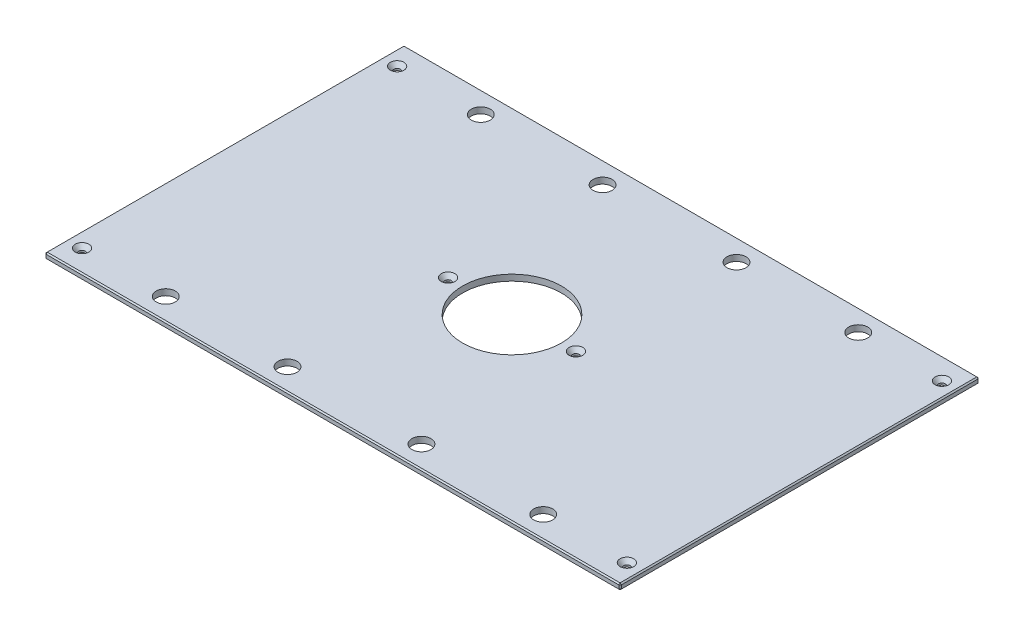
ISO-10303-21;
HEADER;
FILE_DESCRIPTION(('STEP AP214'),'2;1');
FILE_NAME('part.step','',(''),(''),'','','');
FILE_SCHEMA(('AUTOMOTIVE_DESIGN { 1 0 10303 214 1 1 1 1 }'));
ENDSEC;
DATA;
#1=APPLICATION_CONTEXT('core data for automotive mechanical design processes');
#2=APPLICATION_PROTOCOL_DEFINITION('international standard','automotive_design',2000,#1);
#3=PRODUCT_CONTEXT('',#1,'mechanical');
#4=PRODUCT('Part','Part','',(#3));
#5=PRODUCT_RELATED_PRODUCT_CATEGORY('part','',(#4));
#6=PRODUCT_DEFINITION_FORMATION('','',#4);
#7=PRODUCT_DEFINITION_CONTEXT('part definition',#1,'design');
#8=PRODUCT_DEFINITION('design','',#6,#7);
#9=PRODUCT_DEFINITION_SHAPE('','',#8);
#10=(LENGTH_UNIT() NAMED_UNIT(*) SI_UNIT(.MILLI.,.METRE.));
#11=(NAMED_UNIT(*) PLANE_ANGLE_UNIT() SI_UNIT($,.RADIAN.));
#12=(NAMED_UNIT(*) SI_UNIT($,.STERADIAN.) SOLID_ANGLE_UNIT());
#13=UNCERTAINTY_MEASURE_WITH_UNIT(LENGTH_MEASURE(1.E-05),#10,'distance_accuracy_value','');
#14=(GEOMETRIC_REPRESENTATION_CONTEXT(3) GLOBAL_UNCERTAINTY_ASSIGNED_CONTEXT((#13)) GLOBAL_UNIT_ASSIGNED_CONTEXT((#10,
#11,#12)) REPRESENTATION_CONTEXT('',''));
#15=CARTESIAN_POINT('',(0.,0.,0.));
#16=DIRECTION('',(0.,0.,1.));
#17=DIRECTION('',(1.,0.,0.));
#18=AXIS2_PLACEMENT_3D('',#15,#16,#17);
#19=CARTESIAN_POINT('',(-300.0375,6.35,-187.325));
#20=DIRECTION('',(1.,0.,0.));
#21=DIRECTION('',(0.,0.,-1.));
#22=AXIS2_PLACEMENT_3D('',#19,#20,#21);
#23=PLANE('',#22);
#24=DIRECTION('',(0.,0.,-1.));
#25=VECTOR('',#24,1.);
#26=CARTESIAN_POINT('',(-300.0375,5.08000000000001,-187.325));
#27=LINE('',#26,#25);
#28=CARTESIAN_POINT('',(-300.0375,5.08000000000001,186.055));
#29=VERTEX_POINT('',#28);
#30=CARTESIAN_POINT('',(-300.0375,5.08000000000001,-186.055));
#31=VERTEX_POINT('',#30);
#32=EDGE_CURVE('E134',#29,#31,#27,.T.);
#33=ORIENTED_EDGE('',*,*,#32,.T.);
#34=DIRECTION('',(0.,-1.,0.));
#35=VECTOR('',#34,1.);
#36=CARTESIAN_POINT('',(-300.0375,6.35,-186.055));
#37=LINE('',#36,#35);
#38=CARTESIAN_POINT('',(-300.0375,1.26999999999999,-186.055));
#39=VERTEX_POINT('',#38);
#40=EDGE_CURVE('E130',#31,#39,#37,.T.);
#41=ORIENTED_EDGE('',*,*,#40,.T.);
#42=DIRECTION('',(0.,0.,1.));
#43=VECTOR('',#42,1.);
#44=CARTESIAN_POINT('',(-300.0375,1.26999999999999,-187.325));
#45=LINE('',#44,#43);
#46=CARTESIAN_POINT('',(-300.0375,1.26999999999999,186.055));
#47=VERTEX_POINT('',#46);
#48=EDGE_CURVE('E125',#39,#47,#45,.T.);
#49=ORIENTED_EDGE('',*,*,#48,.T.);
#50=DIRECTION('',(0.,1.,0.));
#51=VECTOR('',#50,1.);
#52=CARTESIAN_POINT('',(-300.0375,6.35,186.055));
#53=LINE('',#52,#51);
#54=EDGE_CURVE('E127',#47,#29,#53,.T.);
#55=ORIENTED_EDGE('',*,*,#54,.T.);
#56=EDGE_LOOP('',(#33,#41,#49,#55));
#57=FACE_BOUND('',#56,.T.);
#58=ADVANCED_FACE('F34',(#57),#23,.F.);
#59=CARTESIAN_POINT('',(-300.0375,6.35,187.325));
#60=DIRECTION('',(0.,0.,-1.));
#61=DIRECTION('',(-1.,0.,0.));
#62=AXIS2_PLACEMENT_3D('',#59,#60,#61);
#63=PLANE('',#62);
#64=DIRECTION('',(1.,0.,0.));
#65=VECTOR('',#64,1.);
#66=CARTESIAN_POINT('',(-300.0375,1.26999999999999,187.325));
#67=LINE('',#66,#65);
#68=CARTESIAN_POINT('',(-298.7675,1.26999999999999,187.325));
#69=VERTEX_POINT('',#68);
#70=CARTESIAN_POINT('',(298.7675,1.26999999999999,187.325));
#71=VERTEX_POINT('',#70);
#72=EDGE_CURVE('E57',#69,#71,#67,.T.);
#73=ORIENTED_EDGE('',*,*,#72,.T.);
#74=DIRECTION('',(0.,1.,0.));
#75=VECTOR('',#74,1.);
#76=CARTESIAN_POINT('',(298.7675,6.35,187.325));
#77=LINE('',#76,#75);
#78=CARTESIAN_POINT('',(298.7675,5.08000000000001,187.325));
#79=VERTEX_POINT('',#78);
#80=EDGE_CURVE('E11',#71,#79,#77,.T.);
#81=ORIENTED_EDGE('',*,*,#80,.T.);
#82=DIRECTION('',(-1.,0.,0.));
#83=VECTOR('',#82,1.);
#84=CARTESIAN_POINT('',(-300.0375,5.08000000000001,187.325));
#85=LINE('',#84,#83);
#86=CARTESIAN_POINT('',(-298.7675,5.08000000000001,187.325));
#87=VERTEX_POINT('',#86);
#88=EDGE_CURVE('E43',#79,#87,#85,.T.);
#89=ORIENTED_EDGE('',*,*,#88,.T.);
#90=DIRECTION('',(0.,-1.,0.));
#91=VECTOR('',#90,1.);
#92=CARTESIAN_POINT('',(-298.7675,6.35,187.325));
#93=LINE('',#92,#91);
#94=EDGE_CURVE('E302',#87,#69,#93,.T.);
#95=ORIENTED_EDGE('',*,*,#94,.T.);
#96=EDGE_LOOP('',(#73,#81,#89,#95));
#97=FACE_BOUND('',#96,.T.);
#98=ADVANCED_FACE('F371',(#97),#63,.F.);
#99=CARTESIAN_POINT('',(300.0375,6.35,-187.325));
#100=DIRECTION('',(-1.,0.,0.));
#101=DIRECTION('',(0.,0.,1.));
#102=AXIS2_PLACEMENT_3D('',#99,#100,#101);
#103=PLANE('',#102);
#104=DIRECTION('',(0.,0.,-1.));
#105=VECTOR('',#104,1.);
#106=CARTESIAN_POINT('',(300.0375,1.26999999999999,-187.325));
#107=LINE('',#106,#105);
#108=CARTESIAN_POINT('',(300.0375,1.26999999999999,186.055));
#109=VERTEX_POINT('',#108);
#110=CARTESIAN_POINT('',(300.0375,1.26999999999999,-186.055));
#111=VERTEX_POINT('',#110);
#112=EDGE_CURVE('E297',#109,#111,#107,.T.);
#113=ORIENTED_EDGE('',*,*,#112,.T.);
#114=DIRECTION('',(0.,1.,0.));
#115=VECTOR('',#114,1.);
#116=CARTESIAN_POINT('',(300.0375,6.35,-186.055));
#117=LINE('',#116,#115);
#118=CARTESIAN_POINT('',(300.0375,5.08000000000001,-186.055));
#119=VERTEX_POINT('',#118);
#120=EDGE_CURVE('E299',#111,#119,#117,.T.);
#121=ORIENTED_EDGE('',*,*,#120,.T.);
#122=DIRECTION('',(0.,0.,1.));
#123=VECTOR('',#122,1.);
#124=CARTESIAN_POINT('',(300.0375,5.08000000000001,187.325));
#125=LINE('',#124,#123);
#126=CARTESIAN_POINT('',(300.0375,5.08000000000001,186.055));
#127=VERTEX_POINT('',#126);
#128=EDGE_CURVE('E295',#119,#127,#125,.T.);
#129=ORIENTED_EDGE('',*,*,#128,.T.);
#130=DIRECTION('',(0.,-1.,0.));
#131=VECTOR('',#130,1.);
#132=CARTESIAN_POINT('',(300.0375,6.35,186.055));
#133=LINE('',#132,#131);
#134=EDGE_CURVE('E293',#127,#109,#133,.T.);
#135=ORIENTED_EDGE('',*,*,#134,.T.);
#136=EDGE_LOOP('',(#113,#121,#129,#135));
#137=FACE_BOUND('',#136,.T.);
#138=ADVANCED_FACE('F358',(#137),#103,.F.);
#139=CARTESIAN_POINT('',(-300.0375,6.35,-187.325));
#140=DIRECTION('',(0.,0.,1.));
#141=DIRECTION('',(1.,0.,0.));
#142=AXIS2_PLACEMENT_3D('',#139,#140,#141);
#143=PLANE('',#142);
#144=DIRECTION('',(-1.,0.,0.));
#145=VECTOR('',#144,1.);
#146=CARTESIAN_POINT('',(-300.0375,1.26999999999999,-187.325));
#147=LINE('',#146,#145);
#148=CARTESIAN_POINT('',(298.7675,1.26999999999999,-187.325));
#149=VERTEX_POINT('',#148);
#150=CARTESIAN_POINT('',(-298.7675,1.26999999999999,-187.325));
#151=VERTEX_POINT('',#150);
#152=EDGE_CURVE('E269',#149,#151,#147,.T.);
#153=ORIENTED_EDGE('',*,*,#152,.T.);
#154=DIRECTION('',(0.,1.,0.));
#155=VECTOR('',#154,1.);
#156=CARTESIAN_POINT('',(-298.7675,6.35,-187.325));
#157=LINE('',#156,#155);
#158=CARTESIAN_POINT('',(-298.7675,5.08000000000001,-187.325));
#159=VERTEX_POINT('',#158);
#160=EDGE_CURVE('E273',#151,#159,#157,.T.);
#161=ORIENTED_EDGE('',*,*,#160,.T.);
#162=DIRECTION('',(1.,0.,0.));
#163=VECTOR('',#162,1.);
#164=CARTESIAN_POINT('',(300.0375,5.08000000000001,-187.325));
#165=LINE('',#164,#163);
#166=CARTESIAN_POINT('',(298.7675,5.08000000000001,-187.325));
#167=VERTEX_POINT('',#166);
#168=EDGE_CURVE('E271',#159,#167,#165,.T.);
#169=ORIENTED_EDGE('',*,*,#168,.T.);
#170=DIRECTION('',(0.,-1.,0.));
#171=VECTOR('',#170,1.);
#172=CARTESIAN_POINT('',(298.7675,6.35,-187.325));
#173=LINE('',#172,#171);
#174=EDGE_CURVE('E267',#167,#149,#173,.T.);
#175=ORIENTED_EDGE('',*,*,#174,.T.);
#176=EDGE_LOOP('',(#153,#161,#169,#175));
#177=FACE_BOUND('',#176,.T.);
#178=ADVANCED_FACE('F332',(#177),#143,.F.);
#179=CARTESIAN_POINT('',(0.,6.35,0.));
#180=DIRECTION('',(0.,1.,0.));
#181=DIRECTION('',(0.,0.,1.));
#182=AXIS2_PLACEMENT_3D('',#179,#180,#181);
#183=PLANE('',#182);
#184=CARTESIAN_POINT('',(284.1625,6.35,-164.30498));
#185=DIRECTION('',(0.,1.,0.));
#186=DIRECTION('',(0.,0.,1.));
#187=AXIS2_PLACEMENT_3D('',#184,#185,#186);
#188=CIRCLE('',#187,7.13740000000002);
#189=CARTESIAN_POINT('',(284.1625,6.35,-157.16758));
#190=VERTEX_POINT('',#189);
#191=EDGE_CURVE('E815',#190,#190,#188,.T.);
#192=ORIENTED_EDGE('',*,*,#191,.F.);
#193=EDGE_LOOP('',(#192));
#194=FACE_BOUND('',#193,.T.);
#195=CARTESIAN_POINT('',(284.1625,6.35,164.30498));
#196=DIRECTION('',(0.,1.,0.));
#197=DIRECTION('',(0.,0.,1.));
#198=AXIS2_PLACEMENT_3D('',#195,#196,#197);
#199=CIRCLE('',#198,7.13740000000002);
#200=CARTESIAN_POINT('',(284.1625,6.35,171.44238));
#201=VERTEX_POINT('',#200);
#202=EDGE_CURVE('E819',#201,#201,#199,.T.);
#203=ORIENTED_EDGE('',*,*,#202,.F.);
#204=EDGE_LOOP('',(#203));
#205=FACE_BOUND('',#204,.T.);
#206=CARTESIAN_POINT('',(-284.1625,6.35,164.30498));
#207=DIRECTION('',(0.,1.,0.));
#208=DIRECTION('',(0.,0.,1.));
#209=AXIS2_PLACEMENT_3D('',#206,#207,#208);
#210=CIRCLE('',#209,7.13740000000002);
#211=CARTESIAN_POINT('',(-284.1625,6.35,171.44238));
#212=VERTEX_POINT('',#211);
#213=EDGE_CURVE('E823',#212,#212,#210,.T.);
#214=ORIENTED_EDGE('',*,*,#213,.F.);
#215=EDGE_LOOP('',(#214));
#216=FACE_BOUND('',#215,.T.);
#217=CARTESIAN_POINT('',(-66.675,6.35,0.));
#218=DIRECTION('',(0.,1.,0.));
#219=DIRECTION('',(0.,0.,1.));
#220=AXIS2_PLACEMENT_3D('',#217,#218,#219);
#221=CIRCLE('',#220,7.1374);
#222=CARTESIAN_POINT('',(-66.675,6.35,7.1374));
#223=VERTEX_POINT('',#222);
#224=EDGE_CURVE('E827',#223,#223,#221,.T.);
#225=ORIENTED_EDGE('',*,*,#224,.F.);
#226=EDGE_LOOP('',(#225));
#227=FACE_BOUND('',#226,.T.);
#228=CARTESIAN_POINT('',(66.675,6.35,0.));
#229=DIRECTION('',(0.,1.,0.));
#230=DIRECTION('',(0.,0.,1.));
#231=AXIS2_PLACEMENT_3D('',#228,#229,#230);
#232=CIRCLE('',#231,7.1374);
#233=CARTESIAN_POINT('',(66.675,6.35,7.1374));
#234=VERTEX_POINT('',#233);
#235=EDGE_CURVE('E831',#234,#234,#232,.T.);
#236=ORIENTED_EDGE('',*,*,#235,.F.);
#237=EDGE_LOOP('',(#236));
#238=FACE_BOUND('',#237,.T.);
#239=CARTESIAN_POINT('',(-284.1625,6.35,-164.30498));
#240=DIRECTION('',(0.,1.,0.));
#241=DIRECTION('',(0.,0.,1.));
#242=AXIS2_PLACEMENT_3D('',#239,#240,#241);
#243=CIRCLE('',#242,7.13740000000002);
#244=CARTESIAN_POINT('',(-284.1625,6.35,-157.16758));
#245=VERTEX_POINT('',#244);
#246=EDGE_CURVE('E834',#245,#245,#243,.T.);
#247=ORIENTED_EDGE('',*,*,#246,.F.);
#248=EDGE_LOOP('',(#247));
#249=FACE_BOUND('',#248,.T.);
#250=DIRECTION('',(0.,0.,-1.));
#251=VECTOR('',#250,1.);
#252=CARTESIAN_POINT('',(298.7675,6.35,-187.325));
#253=LINE('',#252,#251);
#254=CARTESIAN_POINT('',(298.7675,6.35,186.055));
#255=VERTEX_POINT('',#254);
#256=CARTESIAN_POINT('',(298.7675,6.35,-186.055));
#257=VERTEX_POINT('',#256);
#258=EDGE_CURVE('E280',#255,#257,#253,.T.);
#259=ORIENTED_EDGE('',*,*,#258,.T.);
#260=DIRECTION('',(-1.,0.,0.));
#261=VECTOR('',#260,1.);
#262=CARTESIAN_POINT('',(-300.0375,6.35,-186.055));
#263=LINE('',#262,#261);
#264=CARTESIAN_POINT('',(-298.7675,6.35,-186.055));
#265=VERTEX_POINT('',#264);
#266=EDGE_CURVE('E282',#257,#265,#263,.T.);
#267=ORIENTED_EDGE('',*,*,#266,.T.);
#268=DIRECTION('',(0.,0.,1.));
#269=VECTOR('',#268,1.);
#270=CARTESIAN_POINT('',(-298.7675,6.35,187.325));
#271=LINE('',#270,#269);
#272=CARTESIAN_POINT('',(-298.7675,6.35,186.055));
#273=VERTEX_POINT('',#272);
#274=EDGE_CURVE('E278',#265,#273,#271,.T.);
#275=ORIENTED_EDGE('',*,*,#274,.T.);
#276=DIRECTION('',(1.,0.,0.));
#277=VECTOR('',#276,1.);
#278=CARTESIAN_POINT('',(300.0375,6.35,186.055));
#279=LINE('',#278,#277);
#280=EDGE_CURVE('E276',#273,#255,#279,.T.);
#281=ORIENTED_EDGE('',*,*,#280,.T.);
#282=EDGE_LOOP('',(#259,#267,#275,#281));
#283=FACE_BOUND('',#282,.T.);
#284=CARTESIAN_POINT('',(196.85,6.35,-164.30498));
#285=DIRECTION('',(0.,1.,0.));
#286=DIRECTION('',(0.,0.,1.));
#287=AXIS2_PLACEMENT_3D('',#284,#285,#286);
#288=CIRCLE('',#287,9.921875);
#289=CARTESIAN_POINT('',(196.85,6.35,-154.383105));
#290=VERTEX_POINT('',#289);
#291=EDGE_CURVE('E203',#290,#290,#288,.T.);
#292=ORIENTED_EDGE('',*,*,#291,.F.);
#293=EDGE_LOOP('',(#292));
#294=FACE_BOUND('',#293,.T.);
#295=CARTESIAN_POINT('',(-196.85,6.35,-164.30498));
#296=DIRECTION('',(0.,1.,0.));
#297=DIRECTION('',(0.,0.,1.));
#298=AXIS2_PLACEMENT_3D('',#295,#296,#297);
#299=CIRCLE('',#298,9.921875);
#300=CARTESIAN_POINT('',(-196.85,6.35,-154.383105));
#301=VERTEX_POINT('',#300);
#302=EDGE_CURVE('E213',#301,#301,#299,.T.);
#303=ORIENTED_EDGE('',*,*,#302,.F.);
#304=EDGE_LOOP('',(#303));
#305=FACE_BOUND('',#304,.T.);
#306=CARTESIAN_POINT('',(196.85,6.35,164.30498));
#307=DIRECTION('',(0.,1.,0.));
#308=DIRECTION('',(0.,0.,1.));
#309=AXIS2_PLACEMENT_3D('',#306,#307,#308);
#310=CIRCLE('',#309,9.921875);
#311=CARTESIAN_POINT('',(196.85,6.35,174.226855));
#312=VERTEX_POINT('',#311);
#313=EDGE_CURVE('E224',#312,#312,#310,.T.);
#314=ORIENTED_EDGE('',*,*,#313,.F.);
#315=EDGE_LOOP('',(#314));
#316=FACE_BOUND('',#315,.T.);
#317=CARTESIAN_POINT('',(-196.85,6.35,164.30498));
#318=DIRECTION('',(0.,1.,0.));
#319=DIRECTION('',(0.,0.,1.));
#320=AXIS2_PLACEMENT_3D('',#317,#318,#319);
#321=CIRCLE('',#320,9.921875);
#322=CARTESIAN_POINT('',(-196.85,6.35,174.226855));
#323=VERTEX_POINT('',#322);
#324=EDGE_CURVE('E230',#323,#323,#321,.T.);
#325=ORIENTED_EDGE('',*,*,#324,.F.);
#326=EDGE_LOOP('',(#325));
#327=FACE_BOUND('',#326,.T.);
#328=CARTESIAN_POINT('',(-69.85,6.35,-164.30498));
#329=DIRECTION('',(0.,1.,0.));
#330=DIRECTION('',(0.,0.,1.));
#331=AXIS2_PLACEMENT_3D('',#328,#329,#330);
#332=CIRCLE('',#331,9.921875);
#333=CARTESIAN_POINT('',(-69.85,6.35,-154.383105));
#334=VERTEX_POINT('',#333);
#335=EDGE_CURVE('E236',#334,#334,#332,.T.);
#336=ORIENTED_EDGE('',*,*,#335,.F.);
#337=EDGE_LOOP('',(#336));
#338=FACE_BOUND('',#337,.T.);
#339=CARTESIAN_POINT('',(69.85,6.35,-164.30498));
#340=DIRECTION('',(0.,1.,0.));
#341=DIRECTION('',(0.,0.,1.));
#342=AXIS2_PLACEMENT_3D('',#339,#340,#341);
#343=CIRCLE('',#342,9.921875);
#344=CARTESIAN_POINT('',(69.85,6.35,-154.383105));
#345=VERTEX_POINT('',#344);
#346=EDGE_CURVE('E242',#345,#345,#343,.T.);
#347=ORIENTED_EDGE('',*,*,#346,.F.);
#348=EDGE_LOOP('',(#347));
#349=FACE_BOUND('',#348,.T.);
#350=CARTESIAN_POINT('',(69.85,6.35,164.30498));
#351=DIRECTION('',(0.,1.,0.));
#352=DIRECTION('',(0.,0.,1.));
#353=AXIS2_PLACEMENT_3D('',#350,#351,#352);
#354=CIRCLE('',#353,9.921875);
#355=CARTESIAN_POINT('',(69.85,6.35,174.226855));
#356=VERTEX_POINT('',#355);
#357=EDGE_CURVE('E248',#356,#356,#354,.T.);
#358=ORIENTED_EDGE('',*,*,#357,.F.);
#359=EDGE_LOOP('',(#358));
#360=FACE_BOUND('',#359,.T.);
#361=CARTESIAN_POINT('',(-69.85,6.35,164.30498));
#362=DIRECTION('',(0.,1.,0.));
#363=DIRECTION('',(0.,0.,1.));
#364=AXIS2_PLACEMENT_3D('',#361,#362,#363);
#365=CIRCLE('',#364,9.921875);
#366=CARTESIAN_POINT('',(-69.85,6.35,174.226855));
#367=VERTEX_POINT('',#366);
#368=EDGE_CURVE('E254',#367,#367,#365,.T.);
#369=ORIENTED_EDGE('',*,*,#368,.F.);
#370=EDGE_LOOP('',(#369));
#371=FACE_BOUND('',#370,.T.);
#372=CARTESIAN_POINT('',(0.,6.35,0.));
#373=DIRECTION('',(0.,1.,0.));
#374=DIRECTION('',(0.,0.,1.));
#375=AXIS2_PLACEMENT_3D('',#372,#373,#374);
#376=CIRCLE('',#375,51.562);
#377=CARTESIAN_POINT('',(0.,6.35,51.562));
#378=VERTEX_POINT('',#377);
#379=EDGE_CURVE('E260',#378,#378,#376,.T.);
#380=ORIENTED_EDGE('',*,*,#379,.F.);
#381=EDGE_LOOP('',(#380));
#382=FACE_BOUND('',#381,.T.);
#383=ADVANCED_FACE('F380',(#194,#205,#216,#227,#238,#249,#283,#294,#305,#316,#327,#338,#349,
#360,#371,#382),#183,.T.);
#384=CARTESIAN_POINT('',(0.,0.,0.));
#385=DIRECTION('',(0.,1.,0.));
#386=DIRECTION('',(0.,0.,1.));
#387=AXIS2_PLACEMENT_3D('',#384,#385,#386);
#388=PLANE('',#387);
#389=CARTESIAN_POINT('',(284.1625,0.,-164.30498));
#390=DIRECTION('',(0.,1.,0.));
#391=DIRECTION('',(0.,0.,1.));
#392=AXIS2_PLACEMENT_3D('',#389,#390,#391);
#393=CIRCLE('',#392,3.3782);
#394=CARTESIAN_POINT('',(284.1625,0.,-160.92678));
#395=VERTEX_POINT('',#394);
#396=EDGE_CURVE('E868',#395,#395,#393,.T.);
#397=ORIENTED_EDGE('',*,*,#396,.T.);
#398=EDGE_LOOP('',(#397));
#399=FACE_BOUND('',#398,.T.);
#400=CARTESIAN_POINT('',(284.1625,0.,164.30498));
#401=DIRECTION('',(0.,1.,0.));
#402=DIRECTION('',(0.,0.,1.));
#403=AXIS2_PLACEMENT_3D('',#400,#401,#402);
#404=CIRCLE('',#403,3.3782);
#405=CARTESIAN_POINT('',(284.1625,0.,167.68318));
#406=VERTEX_POINT('',#405);
#407=EDGE_CURVE('E861',#406,#406,#404,.T.);
#408=ORIENTED_EDGE('',*,*,#407,.T.);
#409=EDGE_LOOP('',(#408));
#410=FACE_BOUND('',#409,.T.);
#411=CARTESIAN_POINT('',(-284.1625,0.,164.30498));
#412=DIRECTION('',(0.,1.,0.));
#413=DIRECTION('',(0.,0.,1.));
#414=AXIS2_PLACEMENT_3D('',#411,#412,#413);
#415=CIRCLE('',#414,3.3782);
#416=CARTESIAN_POINT('',(-284.1625,0.,167.68318));
#417=VERTEX_POINT('',#416);
#418=EDGE_CURVE('E854',#417,#417,#415,.T.);
#419=ORIENTED_EDGE('',*,*,#418,.T.);
#420=EDGE_LOOP('',(#419));
#421=FACE_BOUND('',#420,.T.);
#422=CARTESIAN_POINT('',(-66.675,0.,0.));
#423=DIRECTION('',(0.,1.,0.));
#424=DIRECTION('',(0.,0.,1.));
#425=AXIS2_PLACEMENT_3D('',#422,#423,#424);
#426=CIRCLE('',#425,3.3782);
#427=CARTESIAN_POINT('',(-66.675,0.,3.3782));
#428=VERTEX_POINT('',#427);
#429=EDGE_CURVE('E847',#428,#428,#426,.T.);
#430=ORIENTED_EDGE('',*,*,#429,.T.);
#431=EDGE_LOOP('',(#430));
#432=FACE_BOUND('',#431,.T.);
#433=CARTESIAN_POINT('',(66.675,0.,0.));
#434=DIRECTION('',(0.,1.,0.));
#435=DIRECTION('',(0.,0.,1.));
#436=AXIS2_PLACEMENT_3D('',#433,#434,#435);
#437=CIRCLE('',#436,3.3782);
#438=CARTESIAN_POINT('',(66.675,0.,3.3782));
#439=VERTEX_POINT('',#438);
#440=EDGE_CURVE('E837',#439,#439,#437,.T.);
#441=ORIENTED_EDGE('',*,*,#440,.T.);
#442=EDGE_LOOP('',(#441));
#443=FACE_BOUND('',#442,.T.);
#444=CARTESIAN_POINT('',(-284.1625,0.,-164.30498));
#445=DIRECTION('',(0.,1.,0.));
#446=DIRECTION('',(0.,0.,1.));
#447=AXIS2_PLACEMENT_3D('',#444,#445,#446);
#448=CIRCLE('',#447,3.3782);
#449=CARTESIAN_POINT('',(-284.1625,0.,-160.92678));
#450=VERTEX_POINT('',#449);
#451=EDGE_CURVE('E216',#450,#450,#448,.T.);
#452=ORIENTED_EDGE('',*,*,#451,.T.);
#453=EDGE_LOOP('',(#452));
#454=FACE_BOUND('',#453,.T.);
#455=DIRECTION('',(0.,0.,-1.));
#456=VECTOR('',#455,1.);
#457=CARTESIAN_POINT('',(-298.7675,0.,0.));
#458=LINE('',#457,#456);
#459=CARTESIAN_POINT('',(-298.7675,0.,186.055));
#460=VERTEX_POINT('',#459);
#461=CARTESIAN_POINT('',(-298.7675,0.,-186.055));
#462=VERTEX_POINT('',#461);
#463=EDGE_CURVE('E157',#460,#462,#458,.T.);
#464=ORIENTED_EDGE('',*,*,#463,.T.);
#465=DIRECTION('',(1.,0.,0.));
#466=VECTOR('',#465,1.);
#467=CARTESIAN_POINT('',(0.,0.,-186.055));
#468=LINE('',#467,#466);
#469=CARTESIAN_POINT('',(298.7675,0.,-186.055));
#470=VERTEX_POINT('',#469);
#471=EDGE_CURVE('E290',#462,#470,#468,.T.);
#472=ORIENTED_EDGE('',*,*,#471,.T.);
#473=DIRECTION('',(0.,0.,1.));
#474=VECTOR('',#473,1.);
#475=CARTESIAN_POINT('',(298.7675,0.,0.));
#476=LINE('',#475,#474);
#477=CARTESIAN_POINT('',(298.7675,0.,186.055));
#478=VERTEX_POINT('',#477);
#479=EDGE_CURVE('E288',#470,#478,#476,.T.);
#480=ORIENTED_EDGE('',*,*,#479,.T.);
#481=DIRECTION('',(-1.,0.,0.));
#482=VECTOR('',#481,1.);
#483=CARTESIAN_POINT('',(0.,0.,186.055));
#484=LINE('',#483,#482);
#485=EDGE_CURVE('E285',#478,#460,#484,.T.);
#486=ORIENTED_EDGE('',*,*,#485,.T.);
#487=EDGE_LOOP('',(#464,#472,#480,#486));
#488=FACE_BOUND('',#487,.T.);
#489=CARTESIAN_POINT('',(196.85,0.,-164.30498));
#490=DIRECTION('',(0.,1.,0.));
#491=DIRECTION('',(0.,0.,1.));
#492=AXIS2_PLACEMENT_3D('',#489,#490,#491);
#493=CIRCLE('',#492,9.921875);
#494=CARTESIAN_POINT('',(196.85,0.,-154.383105));
#495=VERTEX_POINT('',#494);
#496=EDGE_CURVE('E208',#495,#495,#493,.T.);
#497=ORIENTED_EDGE('',*,*,#496,.T.);
#498=EDGE_LOOP('',(#497));
#499=FACE_BOUND('',#498,.T.);
#500=CARTESIAN_POINT('',(-196.85,0.,-164.30498));
#501=DIRECTION('',(0.,1.,0.));
#502=DIRECTION('',(0.,0.,1.));
#503=AXIS2_PLACEMENT_3D('',#500,#501,#502);
#504=CIRCLE('',#503,9.921875);
#505=CARTESIAN_POINT('',(-196.85,0.,-154.383105));
#506=VERTEX_POINT('',#505);
#507=EDGE_CURVE('E221',#506,#506,#504,.T.);
#508=ORIENTED_EDGE('',*,*,#507,.T.);
#509=EDGE_LOOP('',(#508));
#510=FACE_BOUND('',#509,.T.);
#511=CARTESIAN_POINT('',(196.85,0.,164.30498));
#512=DIRECTION('',(0.,1.,0.));
#513=DIRECTION('',(0.,0.,1.));
#514=AXIS2_PLACEMENT_3D('',#511,#512,#513);
#515=CIRCLE('',#514,9.921875);
#516=CARTESIAN_POINT('',(196.85,0.,174.226855));
#517=VERTEX_POINT('',#516);
#518=EDGE_CURVE('E227',#517,#517,#515,.T.);
#519=ORIENTED_EDGE('',*,*,#518,.T.);
#520=EDGE_LOOP('',(#519));
#521=FACE_BOUND('',#520,.T.);
#522=CARTESIAN_POINT('',(-196.85,0.,164.30498));
#523=DIRECTION('',(0.,1.,0.));
#524=DIRECTION('',(0.,0.,1.));
#525=AXIS2_PLACEMENT_3D('',#522,#523,#524);
#526=CIRCLE('',#525,9.921875);
#527=CARTESIAN_POINT('',(-196.85,0.,174.226855));
#528=VERTEX_POINT('',#527);
#529=EDGE_CURVE('E233',#528,#528,#526,.T.);
#530=ORIENTED_EDGE('',*,*,#529,.T.);
#531=EDGE_LOOP('',(#530));
#532=FACE_BOUND('',#531,.T.);
#533=CARTESIAN_POINT('',(-69.85,0.,-164.30498));
#534=DIRECTION('',(0.,1.,0.));
#535=DIRECTION('',(0.,0.,1.));
#536=AXIS2_PLACEMENT_3D('',#533,#534,#535);
#537=CIRCLE('',#536,9.921875);
#538=CARTESIAN_POINT('',(-69.85,0.,-154.383105));
#539=VERTEX_POINT('',#538);
#540=EDGE_CURVE('E239',#539,#539,#537,.T.);
#541=ORIENTED_EDGE('',*,*,#540,.T.);
#542=EDGE_LOOP('',(#541));
#543=FACE_BOUND('',#542,.T.);
#544=CARTESIAN_POINT('',(69.85,0.,-164.30498));
#545=DIRECTION('',(0.,1.,0.));
#546=DIRECTION('',(0.,0.,1.));
#547=AXIS2_PLACEMENT_3D('',#544,#545,#546);
#548=CIRCLE('',#547,9.921875);
#549=CARTESIAN_POINT('',(69.85,0.,-154.383105));
#550=VERTEX_POINT('',#549);
#551=EDGE_CURVE('E245',#550,#550,#548,.T.);
#552=ORIENTED_EDGE('',*,*,#551,.T.);
#553=EDGE_LOOP('',(#552));
#554=FACE_BOUND('',#553,.T.);
#555=CARTESIAN_POINT('',(69.85,0.,164.30498));
#556=DIRECTION('',(0.,1.,0.));
#557=DIRECTION('',(0.,0.,1.));
#558=AXIS2_PLACEMENT_3D('',#555,#556,#557);
#559=CIRCLE('',#558,9.921875);
#560=CARTESIAN_POINT('',(69.85,0.,174.226855));
#561=VERTEX_POINT('',#560);
#562=EDGE_CURVE('E251',#561,#561,#559,.T.);
#563=ORIENTED_EDGE('',*,*,#562,.T.);
#564=EDGE_LOOP('',(#563));
#565=FACE_BOUND('',#564,.T.);
#566=CARTESIAN_POINT('',(-69.85,0.,164.30498));
#567=DIRECTION('',(0.,1.,0.));
#568=DIRECTION('',(0.,0.,1.));
#569=AXIS2_PLACEMENT_3D('',#566,#567,#568);
#570=CIRCLE('',#569,9.921875);
#571=CARTESIAN_POINT('',(-69.85,0.,174.226855));
#572=VERTEX_POINT('',#571);
#573=EDGE_CURVE('E257',#572,#572,#570,.T.);
#574=ORIENTED_EDGE('',*,*,#573,.T.);
#575=EDGE_LOOP('',(#574));
#576=FACE_BOUND('',#575,.T.);
#577=CARTESIAN_POINT('',(0.,0.,0.));
#578=DIRECTION('',(0.,1.,0.));
#579=DIRECTION('',(0.,0.,1.));
#580=AXIS2_PLACEMENT_3D('',#577,#578,#579);
#581=CIRCLE('',#580,51.562);
#582=CARTESIAN_POINT('',(0.,0.,51.562));
#583=VERTEX_POINT('',#582);
#584=EDGE_CURVE('E146',#583,#583,#581,.T.);
#585=ORIENTED_EDGE('',*,*,#584,.T.);
#586=EDGE_LOOP('',(#585));
#587=FACE_BOUND('',#586,.T.);
#588=ADVANCED_FACE('F345',(#399,#410,#421,#432,#443,#454,#488,#499,#510,#521,#532,#543,#554,
#565,#576,#587),#388,.F.);
#589=CARTESIAN_POINT('',(0.,0.,0.));
#590=DIRECTION('',(0.,1.,0.));
#591=DIRECTION('',(0.,0.,1.));
#592=AXIS2_PLACEMENT_3D('',#589,#590,#591);
#593=CYLINDRICAL_SURFACE('',#592,51.562);
#594=ORIENTED_EDGE('',*,*,#584,.F.);
#595=EDGE_LOOP('',(#594));
#596=FACE_BOUND('',#595,.T.);
#597=ORIENTED_EDGE('',*,*,#379,.T.);
#598=EDGE_LOOP('',(#597));
#599=FACE_BOUND('',#598,.T.);
#600=ADVANCED_FACE('F750',(#596,#599),#593,.F.);
#601=CARTESIAN_POINT('',(-69.85,6.35,164.30498));
#602=DIRECTION('',(0.,1.,0.));
#603=DIRECTION('',(0.,0.,1.));
#604=AXIS2_PLACEMENT_3D('',#601,#602,#603);
#605=CYLINDRICAL_SURFACE('',#604,9.921875);
#606=ORIENTED_EDGE('',*,*,#573,.F.);
#607=EDGE_LOOP('',(#606));
#608=FACE_BOUND('',#607,.T.);
#609=ORIENTED_EDGE('',*,*,#368,.T.);
#610=EDGE_LOOP('',(#609));
#611=FACE_BOUND('',#610,.T.);
#612=ADVANCED_FACE('F741',(#608,#611),#605,.F.);
#613=CARTESIAN_POINT('',(69.85,6.35,164.30498));
#614=DIRECTION('',(0.,1.,0.));
#615=DIRECTION('',(0.,0.,1.));
#616=AXIS2_PLACEMENT_3D('',#613,#614,#615);
#617=CYLINDRICAL_SURFACE('',#616,9.921875);
#618=ORIENTED_EDGE('',*,*,#562,.F.);
#619=EDGE_LOOP('',(#618));
#620=FACE_BOUND('',#619,.T.);
#621=ORIENTED_EDGE('',*,*,#357,.T.);
#622=EDGE_LOOP('',(#621));
#623=FACE_BOUND('',#622,.T.);
#624=ADVANCED_FACE('F732',(#620,#623),#617,.F.);
#625=CARTESIAN_POINT('',(69.85,6.35,-164.30498));
#626=DIRECTION('',(0.,1.,0.));
#627=DIRECTION('',(0.,0.,1.));
#628=AXIS2_PLACEMENT_3D('',#625,#626,#627);
#629=CYLINDRICAL_SURFACE('',#628,9.921875);
#630=ORIENTED_EDGE('',*,*,#551,.F.);
#631=EDGE_LOOP('',(#630));
#632=FACE_BOUND('',#631,.T.);
#633=ORIENTED_EDGE('',*,*,#346,.T.);
#634=EDGE_LOOP('',(#633));
#635=FACE_BOUND('',#634,.T.);
#636=ADVANCED_FACE('F723',(#632,#635),#629,.F.);
#637=CARTESIAN_POINT('',(-69.85,6.35,-164.30498));
#638=DIRECTION('',(0.,1.,0.));
#639=DIRECTION('',(0.,0.,1.));
#640=AXIS2_PLACEMENT_3D('',#637,#638,#639);
#641=CYLINDRICAL_SURFACE('',#640,9.921875);
#642=ORIENTED_EDGE('',*,*,#540,.F.);
#643=EDGE_LOOP('',(#642));
#644=FACE_BOUND('',#643,.T.);
#645=ORIENTED_EDGE('',*,*,#335,.T.);
#646=EDGE_LOOP('',(#645));
#647=FACE_BOUND('',#646,.T.);
#648=ADVANCED_FACE('F714',(#644,#647),#641,.F.);
#649=CARTESIAN_POINT('',(-196.85,6.35,164.30498));
#650=DIRECTION('',(0.,1.,0.));
#651=DIRECTION('',(0.,0.,1.));
#652=AXIS2_PLACEMENT_3D('',#649,#650,#651);
#653=CYLINDRICAL_SURFACE('',#652,9.921875);
#654=ORIENTED_EDGE('',*,*,#529,.F.);
#655=EDGE_LOOP('',(#654));
#656=FACE_BOUND('',#655,.T.);
#657=ORIENTED_EDGE('',*,*,#324,.T.);
#658=EDGE_LOOP('',(#657));
#659=FACE_BOUND('',#658,.T.);
#660=ADVANCED_FACE('F705',(#656,#659),#653,.F.);
#661=CARTESIAN_POINT('',(196.85,6.35,164.30498));
#662=DIRECTION('',(0.,1.,0.));
#663=DIRECTION('',(0.,0.,1.));
#664=AXIS2_PLACEMENT_3D('',#661,#662,#663);
#665=CYLINDRICAL_SURFACE('',#664,9.921875);
#666=ORIENTED_EDGE('',*,*,#518,.F.);
#667=EDGE_LOOP('',(#666));
#668=FACE_BOUND('',#667,.T.);
#669=ORIENTED_EDGE('',*,*,#313,.T.);
#670=EDGE_LOOP('',(#669));
#671=FACE_BOUND('',#670,.T.);
#672=ADVANCED_FACE('F696',(#668,#671),#665,.F.);
#673=CARTESIAN_POINT('',(-196.85,6.35,-164.30498));
#674=DIRECTION('',(0.,1.,0.));
#675=DIRECTION('',(0.,0.,1.));
#676=AXIS2_PLACEMENT_3D('',#673,#674,#675);
#677=CYLINDRICAL_SURFACE('',#676,9.921875);
#678=ORIENTED_EDGE('',*,*,#507,.F.);
#679=EDGE_LOOP('',(#678));
#680=FACE_BOUND('',#679,.T.);
#681=ORIENTED_EDGE('',*,*,#302,.T.);
#682=EDGE_LOOP('',(#681));
#683=FACE_BOUND('',#682,.T.);
#684=ADVANCED_FACE('F686',(#680,#683),#677,.F.);
#685=CARTESIAN_POINT('',(196.85,6.35,-164.30498));
#686=DIRECTION('',(0.,1.,0.));
#687=DIRECTION('',(0.,0.,1.));
#688=AXIS2_PLACEMENT_3D('',#685,#686,#687);
#689=CYLINDRICAL_SURFACE('',#688,9.921875);
#690=ORIENTED_EDGE('',*,*,#496,.F.);
#691=EDGE_LOOP('',(#690));
#692=FACE_BOUND('',#691,.T.);
#693=ORIENTED_EDGE('',*,*,#291,.T.);
#694=EDGE_LOOP('',(#693));
#695=FACE_BOUND('',#694,.T.);
#696=ADVANCED_FACE('F389',(#692,#695),#689,.F.);
#697=CARTESIAN_POINT('',(300.0375,6.35,186.055));
#698=DIRECTION('',(-0.707106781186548,0.,-0.707106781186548));
#699=DIRECTION('',(0.,-1.,0.));
#700=AXIS2_PLACEMENT_3D('',#697,#698,#699);
#701=PLANE('',#700);
#702=DIRECTION('',(-0.707106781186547,0.,0.707106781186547));
#703=VECTOR('',#702,1.);
#704=CARTESIAN_POINT('',(300.0375,5.08000000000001,186.055));
#705=LINE('',#704,#703);
#706=EDGE_CURVE('E38',#79,#127,#705,.F.);
#707=ORIENTED_EDGE('',*,*,#706,.F.);
#708=ORIENTED_EDGE('',*,*,#80,.F.);
#709=DIRECTION('',(0.707106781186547,0.,-0.707106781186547));
#710=VECTOR('',#709,1.);
#711=CARTESIAN_POINT('',(299.4025,1.26999999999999,186.69));
#712=LINE('',#711,#710);
#713=EDGE_CURVE('E196',#109,#71,#712,.F.);
#714=ORIENTED_EDGE('',*,*,#713,.F.);
#715=ORIENTED_EDGE('',*,*,#134,.F.);
#716=EDGE_LOOP('',(#707,#708,#714,#715));
#717=FACE_BOUND('',#716,.T.);
#718=ADVANCED_FACE('F36',(#717),#701,.F.);
#719=CARTESIAN_POINT('',(300.0375,5.08000000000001,186.055));
#720=DIRECTION('',(0.577350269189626,0.577350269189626,0.577350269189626));
#721=DIRECTION('',(0.707106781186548,0.,-0.707106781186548));
#722=AXIS2_PLACEMENT_3D('',#719,#720,#721);
#723=PLANE('',#722);
#724=DIRECTION('',(0.,-0.707106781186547,0.707106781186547));
#725=VECTOR('',#724,1.);
#726=CARTESIAN_POINT('',(298.7675,5.715,186.69));
#727=LINE('',#726,#725);
#728=EDGE_CURVE('E192',#79,#255,#727,.F.);
#729=ORIENTED_EDGE('',*,*,#728,.F.);
#730=ORIENTED_EDGE('',*,*,#706,.T.);
#731=DIRECTION('',(-0.707106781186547,0.707106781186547,0.));
#732=VECTOR('',#731,1.);
#733=CARTESIAN_POINT('',(300.0375,5.08000000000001,186.055));
#734=LINE('',#733,#732);
#735=EDGE_CURVE('E194',#255,#127,#734,.F.);
#736=ORIENTED_EDGE('',*,*,#735,.F.);
#737=EDGE_LOOP('',(#729,#730,#736));
#738=FACE_BOUND('',#737,.T.);
#739=ADVANCED_FACE('F382',(#738),#723,.T.);
#740=CARTESIAN_POINT('',(298.7675,0.,186.055));
#741=DIRECTION('',(0.577350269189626,-0.577350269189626,0.577350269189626));
#742=DIRECTION('',(0.707106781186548,0.,-0.707106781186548));
#743=AXIS2_PLACEMENT_3D('',#740,#741,#742);
#744=PLANE('',#743);
#745=DIRECTION('',(-0.707106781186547,-0.707106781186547,0.));
#746=VECTOR('',#745,1.);
#747=CARTESIAN_POINT('',(298.7675,0.,186.055));
#748=LINE('',#747,#746);
#749=EDGE_CURVE('E186',#109,#478,#748,.T.);
#750=ORIENTED_EDGE('',*,*,#749,.F.);
#751=ORIENTED_EDGE('',*,*,#713,.T.);
#752=DIRECTION('',(0.,0.707106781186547,0.707106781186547));
#753=VECTOR('',#752,1.);
#754=CARTESIAN_POINT('',(298.7675,0.,186.055));
#755=LINE('',#754,#753);
#756=EDGE_CURVE('E189',#478,#71,#755,.T.);
#757=ORIENTED_EDGE('',*,*,#756,.F.);
#758=EDGE_LOOP('',(#750,#751,#757));
#759=FACE_BOUND('',#758,.T.);
#760=ADVANCED_FACE('F351',(#759),#744,.T.);
#761=CARTESIAN_POINT('',(298.7675,6.35,0.));
#762=DIRECTION('',(0.707106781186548,0.707106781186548,0.));
#763=DIRECTION('',(0.,0.,1.));
#764=AXIS2_PLACEMENT_3D('',#761,#762,#763);
#765=PLANE('',#764);
#766=ORIENTED_EDGE('',*,*,#735,.T.);
#767=ORIENTED_EDGE('',*,*,#128,.F.);
#768=DIRECTION('',(0.707106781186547,-0.707106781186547,0.));
#769=VECTOR('',#768,1.);
#770=CARTESIAN_POINT('',(299.4025,5.715,-186.055));
#771=LINE('',#770,#769);
#772=EDGE_CURVE('E181',#257,#119,#771,.T.);
#773=ORIENTED_EDGE('',*,*,#772,.F.);
#774=ORIENTED_EDGE('',*,*,#258,.F.);
#775=EDGE_LOOP('',(#766,#767,#773,#774));
#776=FACE_BOUND('',#775,.T.);
#777=ADVANCED_FACE('F368',(#776),#765,.T.);
#778=CARTESIAN_POINT('',(0.,6.35,186.055));
#779=DIRECTION('',(0.,0.707106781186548,0.707106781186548));
#780=DIRECTION('',(-1.,0.,0.));
#781=AXIS2_PLACEMENT_3D('',#778,#779,#780);
#782=PLANE('',#781);
#783=ORIENTED_EDGE('',*,*,#728,.T.);
#784=ORIENTED_EDGE('',*,*,#280,.F.);
#785=DIRECTION('',(0.,0.707106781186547,-0.707106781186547));
#786=VECTOR('',#785,1.);
#787=CARTESIAN_POINT('',(-298.7675,6.35,186.055));
#788=LINE('',#787,#786);
#789=EDGE_CURVE('E178',#87,#273,#788,.T.);
#790=ORIENTED_EDGE('',*,*,#789,.F.);
#791=ORIENTED_EDGE('',*,*,#88,.F.);
#792=EDGE_LOOP('',(#783,#784,#790,#791));
#793=FACE_BOUND('',#792,.T.);
#794=ADVANCED_FACE('F373',(#793),#782,.T.);
#795=CARTESIAN_POINT('',(-298.7675,6.35,187.325));
#796=DIRECTION('',(0.707106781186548,0.,-0.707106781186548));
#797=DIRECTION('',(0.,-1.,0.));
#798=AXIS2_PLACEMENT_3D('',#795,#796,#797);
#799=PLANE('',#798);
#800=DIRECTION('',(0.707106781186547,0.,0.707106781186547));
#801=VECTOR('',#800,1.);
#802=CARTESIAN_POINT('',(-300.0375,1.26999999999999,186.055));
#803=LINE('',#802,#801);
#804=EDGE_CURVE('E141',#69,#47,#803,.F.);
#805=ORIENTED_EDGE('',*,*,#804,.F.);
#806=ORIENTED_EDGE('',*,*,#94,.F.);
#807=DIRECTION('',(-0.707106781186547,0.,-0.707106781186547));
#808=VECTOR('',#807,1.);
#809=CARTESIAN_POINT('',(-299.4025,5.08000000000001,186.69));
#810=LINE('',#809,#808);
#811=EDGE_CURVE('E144',#29,#87,#810,.F.);
#812=ORIENTED_EDGE('',*,*,#811,.F.);
#813=ORIENTED_EDGE('',*,*,#54,.F.);
#814=EDGE_LOOP('',(#805,#806,#812,#813));
#815=FACE_BOUND('',#814,.T.);
#816=ADVANCED_FACE('F139',(#815),#799,.F.);
#817=CARTESIAN_POINT('',(-300.0375,1.26999999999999,187.325));
#818=DIRECTION('',(0.,0.707106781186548,-0.707106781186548));
#819=DIRECTION('',(1.,0.,0.));
#820=AXIS2_PLACEMENT_3D('',#817,#818,#819);
#821=PLANE('',#820);
#822=ORIENTED_EDGE('',*,*,#756,.T.);
#823=ORIENTED_EDGE('',*,*,#72,.F.);
#824=DIRECTION('',(0.,-0.707106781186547,-0.707106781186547));
#825=VECTOR('',#824,1.);
#826=CARTESIAN_POINT('',(-298.7675,0.634999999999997,186.69));
#827=LINE('',#826,#825);
#828=EDGE_CURVE('E154',#460,#69,#827,.F.);
#829=ORIENTED_EDGE('',*,*,#828,.F.);
#830=ORIENTED_EDGE('',*,*,#485,.F.);
#831=EDGE_LOOP('',(#822,#823,#829,#830));
#832=FACE_BOUND('',#831,.T.);
#833=ADVANCED_FACE('F350',(#832),#821,.F.);
#834=CARTESIAN_POINT('',(300.0375,1.26999999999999,-187.325));
#835=DIRECTION('',(-0.707106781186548,0.707106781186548,0.));
#836=DIRECTION('',(0.,0.,-1.));
#837=AXIS2_PLACEMENT_3D('',#834,#835,#836);
#838=PLANE('',#837);
#839=ORIENTED_EDGE('',*,*,#749,.T.);
#840=ORIENTED_EDGE('',*,*,#479,.F.);
#841=DIRECTION('',(0.707106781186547,0.707106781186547,0.));
#842=VECTOR('',#841,1.);
#843=CARTESIAN_POINT('',(298.7675,0.,-186.055));
#844=LINE('',#843,#842);
#845=EDGE_CURVE('E173',#111,#470,#844,.F.);
#846=ORIENTED_EDGE('',*,*,#845,.F.);
#847=ORIENTED_EDGE('',*,*,#112,.F.);
#848=EDGE_LOOP('',(#839,#840,#846,#847));
#849=FACE_BOUND('',#848,.T.);
#850=ADVANCED_FACE('F355',(#849),#838,.F.);
#851=CARTESIAN_POINT('',(298.7675,6.35,-187.325));
#852=DIRECTION('',(-0.707106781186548,0.,0.707106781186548));
#853=DIRECTION('',(0.,-1.,0.));
#854=AXIS2_PLACEMENT_3D('',#851,#852,#853);
#855=PLANE('',#854);
#856=DIRECTION('',(0.707106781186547,0.,0.707106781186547));
#857=VECTOR('',#856,1.);
#858=CARTESIAN_POINT('',(298.7675,5.08000000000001,-187.325));
#859=LINE('',#858,#857);
#860=EDGE_CURVE('E183',#119,#167,#859,.F.);
#861=ORIENTED_EDGE('',*,*,#860,.F.);
#862=ORIENTED_EDGE('',*,*,#120,.F.);
#863=DIRECTION('',(-0.707106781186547,0.,-0.707106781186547));
#864=VECTOR('',#863,1.);
#865=CARTESIAN_POINT('',(299.4025,1.26999999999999,-186.69));
#866=LINE('',#865,#864);
#867=EDGE_CURVE('E170',#149,#111,#866,.F.);
#868=ORIENTED_EDGE('',*,*,#867,.F.);
#869=ORIENTED_EDGE('',*,*,#174,.F.);
#870=EDGE_LOOP('',(#861,#862,#868,#869));
#871=FACE_BOUND('',#870,.T.);
#872=ADVANCED_FACE('F363',(#871),#855,.F.);
#873=CARTESIAN_POINT('',(298.7675,5.08000000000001,-187.325));
#874=DIRECTION('',(0.577350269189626,0.577350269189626,-0.577350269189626));
#875=DIRECTION('',(-0.707106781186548,0.,-0.707106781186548));
#876=AXIS2_PLACEMENT_3D('',#873,#874,#875);
#877=PLANE('',#876);
#878=ORIENTED_EDGE('',*,*,#772,.T.);
#879=ORIENTED_EDGE('',*,*,#860,.T.);
#880=DIRECTION('',(0.,0.707106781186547,0.707106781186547));
#881=VECTOR('',#880,1.);
#882=CARTESIAN_POINT('',(298.7675,5.08000000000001,-187.325));
#883=LINE('',#882,#881);
#884=EDGE_CURVE('E162',#257,#167,#883,.F.);
#885=ORIENTED_EDGE('',*,*,#884,.F.);
#886=EDGE_LOOP('',(#878,#879,#885));
#887=FACE_BOUND('',#886,.T.);
#888=ADVANCED_FACE('F421',(#887),#877,.T.);
#889=CARTESIAN_POINT('',(-298.7675,6.35,186.055));
#890=DIRECTION('',(-0.577350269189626,0.577350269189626,0.577350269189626));
#891=DIRECTION('',(0.707106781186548,0.,0.707106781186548));
#892=AXIS2_PLACEMENT_3D('',#889,#890,#891);
#893=PLANE('',#892);
#894=ORIENTED_EDGE('',*,*,#811,.T.);
#895=ORIENTED_EDGE('',*,*,#789,.T.);
#896=DIRECTION('',(-0.707106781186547,-0.707106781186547,0.));
#897=VECTOR('',#896,1.);
#898=CARTESIAN_POINT('',(-298.7675,6.35,186.055));
#899=LINE('',#898,#897);
#900=EDGE_CURVE('E158',#29,#273,#899,.F.);
#901=ORIENTED_EDGE('',*,*,#900,.F.);
#902=EDGE_LOOP('',(#894,#895,#901));
#903=FACE_BOUND('',#902,.T.);
#904=ADVANCED_FACE('F375',(#903),#893,.T.);
#905=CARTESIAN_POINT('',(-300.0375,1.26999999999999,186.055));
#906=DIRECTION('',(-0.577350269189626,-0.577350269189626,0.577350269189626));
#907=DIRECTION('',(0.707106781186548,0.,0.707106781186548));
#908=AXIS2_PLACEMENT_3D('',#905,#906,#907);
#909=PLANE('',#908);
#910=ORIENTED_EDGE('',*,*,#828,.T.);
#911=ORIENTED_EDGE('',*,*,#804,.T.);
#912=DIRECTION('',(-0.707106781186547,0.707106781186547,0.));
#913=VECTOR('',#912,1.);
#914=CARTESIAN_POINT('',(-300.0375,1.26999999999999,186.055));
#915=LINE('',#914,#913);
#916=EDGE_CURVE('E151',#460,#47,#915,.T.);
#917=ORIENTED_EDGE('',*,*,#916,.F.);
#918=EDGE_LOOP('',(#910,#911,#917));
#919=FACE_BOUND('',#918,.T.);
#920=ADVANCED_FACE('F150',(#919),#909,.T.);
#921=CARTESIAN_POINT('',(298.7675,0.,-186.055));
#922=DIRECTION('',(0.577350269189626,-0.577350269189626,-0.577350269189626));
#923=DIRECTION('',(-0.707106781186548,0.,-0.707106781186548));
#924=AXIS2_PLACEMENT_3D('',#921,#922,#923);
#925=PLANE('',#924);
#926=ORIENTED_EDGE('',*,*,#867,.T.);
#927=ORIENTED_EDGE('',*,*,#845,.T.);
#928=DIRECTION('',(0.,-0.707106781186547,0.707106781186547));
#929=VECTOR('',#928,1.);
#930=CARTESIAN_POINT('',(298.7675,0.,-186.055));
#931=LINE('',#930,#929);
#932=EDGE_CURVE('E159',#149,#470,#931,.T.);
#933=ORIENTED_EDGE('',*,*,#932,.F.);
#934=EDGE_LOOP('',(#926,#927,#933));
#935=FACE_BOUND('',#934,.T.);
#936=ADVANCED_FACE('F413',(#935),#925,.T.);
#937=CARTESIAN_POINT('',(0.,6.35,-186.055));
#938=DIRECTION('',(0.,0.707106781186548,-0.707106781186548));
#939=DIRECTION('',(1.,0.,0.));
#940=AXIS2_PLACEMENT_3D('',#937,#938,#939);
#941=PLANE('',#940);
#942=ORIENTED_EDGE('',*,*,#884,.T.);
#943=ORIENTED_EDGE('',*,*,#168,.F.);
#944=DIRECTION('',(0.,-0.707106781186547,-0.707106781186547));
#945=VECTOR('',#944,1.);
#946=CARTESIAN_POINT('',(-298.7675,5.08000000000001,-187.325));
#947=LINE('',#946,#945);
#948=EDGE_CURVE('E164',#265,#159,#947,.T.);
#949=ORIENTED_EDGE('',*,*,#948,.F.);
#950=ORIENTED_EDGE('',*,*,#266,.F.);
#951=EDGE_LOOP('',(#942,#943,#949,#950));
#952=FACE_BOUND('',#951,.T.);
#953=ADVANCED_FACE('F327',(#952),#941,.T.);
#954=CARTESIAN_POINT('',(-298.7675,6.35,0.));
#955=DIRECTION('',(-0.707106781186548,0.707106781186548,0.));
#956=DIRECTION('',(0.,0.,-1.));
#957=AXIS2_PLACEMENT_3D('',#954,#955,#956);
#958=PLANE('',#957);
#959=ORIENTED_EDGE('',*,*,#900,.T.);
#960=ORIENTED_EDGE('',*,*,#274,.F.);
#961=DIRECTION('',(0.707106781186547,0.707106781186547,0.));
#962=VECTOR('',#961,1.);
#963=CARTESIAN_POINT('',(-299.4025,5.715,-186.055));
#964=LINE('',#963,#962);
#965=EDGE_CURVE('E316',#31,#265,#964,.T.);
#966=ORIENTED_EDGE('',*,*,#965,.F.);
#967=ORIENTED_EDGE('',*,*,#32,.F.);
#968=EDGE_LOOP('',(#959,#960,#966,#967));
#969=FACE_BOUND('',#968,.T.);
#970=ADVANCED_FACE('F378',(#969),#958,.T.);
#971=CARTESIAN_POINT('',(-300.0375,1.26999999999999,-187.325));
#972=DIRECTION('',(0.707106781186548,0.707106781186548,0.));
#973=DIRECTION('',(0.,0.,1.));
#974=AXIS2_PLACEMENT_3D('',#971,#972,#973);
#975=PLANE('',#974);
#976=ORIENTED_EDGE('',*,*,#916,.T.);
#977=ORIENTED_EDGE('',*,*,#48,.F.);
#978=DIRECTION('',(0.707106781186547,-0.707106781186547,0.));
#979=VECTOR('',#978,1.);
#980=CARTESIAN_POINT('',(-300.0375,1.26999999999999,-186.055));
#981=LINE('',#980,#979);
#982=EDGE_CURVE('E313',#462,#39,#981,.F.);
#983=ORIENTED_EDGE('',*,*,#982,.F.);
#984=ORIENTED_EDGE('',*,*,#463,.F.);
#985=EDGE_LOOP('',(#976,#977,#983,#984));
#986=FACE_BOUND('',#985,.T.);
#987=ADVANCED_FACE('F156',(#986),#975,.F.);
#988=CARTESIAN_POINT('',(-300.0375,1.26999999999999,-187.325));
#989=DIRECTION('',(0.,0.707106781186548,0.707106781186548));
#990=DIRECTION('',(-1.,0.,0.));
#991=AXIS2_PLACEMENT_3D('',#988,#989,#990);
#992=PLANE('',#991);
#993=ORIENTED_EDGE('',*,*,#932,.T.);
#994=ORIENTED_EDGE('',*,*,#471,.F.);
#995=DIRECTION('',(0.,0.707106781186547,-0.707106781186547));
#996=VECTOR('',#995,1.);
#997=CARTESIAN_POINT('',(-298.7675,0.634999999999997,-186.69));
#998=LINE('',#997,#996);
#999=EDGE_CURVE('E310',#151,#462,#998,.F.);
#1000=ORIENTED_EDGE('',*,*,#999,.F.);
#1001=ORIENTED_EDGE('',*,*,#152,.F.);
#1002=EDGE_LOOP('',(#993,#994,#1000,#1001));
#1003=FACE_BOUND('',#1002,.T.);
#1004=ADVANCED_FACE('F342',(#1003),#992,.F.);
#1005=CARTESIAN_POINT('',(-298.7675,5.08000000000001,-187.325));
#1006=DIRECTION('',(-0.577350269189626,0.577350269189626,-0.577350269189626));
#1007=DIRECTION('',(-0.707106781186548,0.,0.707106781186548));
#1008=AXIS2_PLACEMENT_3D('',#1005,#1006,#1007);
#1009=PLANE('',#1008);
#1010=ORIENTED_EDGE('',*,*,#965,.T.);
#1011=ORIENTED_EDGE('',*,*,#948,.T.);
#1012=DIRECTION('',(0.707106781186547,0.,-0.707106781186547));
#1013=VECTOR('',#1012,1.);
#1014=CARTESIAN_POINT('',(-298.7675,5.08000000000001,-187.325));
#1015=LINE('',#1014,#1013);
#1016=EDGE_CURVE('E308',#31,#159,#1015,.T.);
#1017=ORIENTED_EDGE('',*,*,#1016,.F.);
#1018=EDGE_LOOP('',(#1010,#1011,#1017));
#1019=FACE_BOUND('',#1018,.T.);
#1020=ADVANCED_FACE('F322',(#1019),#1009,.T.);
#1021=CARTESIAN_POINT('',(-300.0375,1.26999999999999,-186.055));
#1022=DIRECTION('',(-0.577350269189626,-0.577350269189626,-0.577350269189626));
#1023=DIRECTION('',(-0.707106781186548,0.,0.707106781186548));
#1024=AXIS2_PLACEMENT_3D('',#1021,#1022,#1023);
#1025=PLANE('',#1024);
#1026=ORIENTED_EDGE('',*,*,#999,.T.);
#1027=ORIENTED_EDGE('',*,*,#982,.T.);
#1028=DIRECTION('',(-0.707106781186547,0.,0.707106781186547));
#1029=VECTOR('',#1028,1.);
#1030=CARTESIAN_POINT('',(-300.0375,1.26999999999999,-186.055));
#1031=LINE('',#1030,#1029);
#1032=EDGE_CURVE('E306',#151,#39,#1031,.T.);
#1033=ORIENTED_EDGE('',*,*,#1032,.F.);
#1034=EDGE_LOOP('',(#1026,#1027,#1033));
#1035=FACE_BOUND('',#1034,.T.);
#1036=ADVANCED_FACE('F339',(#1035),#1025,.T.);
#1037=CARTESIAN_POINT('',(-300.0375,6.35,-186.055));
#1038=DIRECTION('',(0.707106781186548,0.,0.707106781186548));
#1039=DIRECTION('',(0.,-1.,0.));
#1040=AXIS2_PLACEMENT_3D('',#1037,#1038,#1039);
#1041=PLANE('',#1040);
#1042=ORIENTED_EDGE('',*,*,#1016,.T.);
#1043=ORIENTED_EDGE('',*,*,#160,.F.);
#1044=ORIENTED_EDGE('',*,*,#1032,.T.);
#1045=ORIENTED_EDGE('',*,*,#40,.F.);
#1046=EDGE_LOOP('',(#1042,#1043,#1044,#1045));
#1047=FACE_BOUND('',#1046,.T.);
#1048=ADVANCED_FACE('F337',(#1047),#1041,.F.);
#1049=CARTESIAN_POINT('',(-284.1625,6.35,-164.30498));
#1050=DIRECTION('',(0.,1.,0.));
#1051=DIRECTION('',(0.,0.,1.));
#1052=AXIS2_PLACEMENT_3D('',#1049,#1050,#1051);
#1053=CYLINDRICAL_SURFACE('',#1052,3.3782);
#1054=ORIENTED_EDGE('',*,*,#451,.F.);
#1055=EDGE_LOOP('',(#1054));
#1056=FACE_BOUND('',#1055,.T.);
#1057=CARTESIAN_POINT('',(-284.1625,2.02553508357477,-164.30498));
#1058=DIRECTION('',(0.,1.,0.));
#1059=DIRECTION('',(0.,0.,1.));
#1060=AXIS2_PLACEMENT_3D('',#1057,#1058,#1059);
#1061=CIRCLE('',#1060,3.3782);
#1062=CARTESIAN_POINT('',(-284.1625,2.02553508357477,-160.92678));
#1063=VERTEX_POINT('',#1062);
#1064=EDGE_CURVE('E836',#1063,#1063,#1061,.T.);
#1065=ORIENTED_EDGE('',*,*,#1064,.T.);
#1066=EDGE_LOOP('',(#1065));
#1067=FACE_BOUND('',#1066,.T.);
#1068=ADVANCED_FACE('F400',(#1056,#1067),#1053,.F.);
#1069=CARTESIAN_POINT('',(-284.1625,6.35,-164.30498));
#1070=DIRECTION('',(0.,1.,0.));
#1071=DIRECTION('',(0.,0.,1.));
#1072=AXIS2_PLACEMENT_3D('',#1069,#1070,#1071);
#1073=CONICAL_SURFACE('',#1072,7.13740000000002,0.715584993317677);
#1074=ORIENTED_EDGE('',*,*,#1064,.F.);
#1075=EDGE_LOOP('',(#1074));
#1076=FACE_BOUND('',#1075,.T.);
#1077=ORIENTED_EDGE('',*,*,#246,.T.);
#1078=EDGE_LOOP('',(#1077));
#1079=FACE_BOUND('',#1078,.T.);
#1080=ADVANCED_FACE('F510',(#1076,#1079),#1073,.F.);
#1081=CARTESIAN_POINT('',(66.675,6.35,0.));
#1082=DIRECTION('',(0.,1.,0.));
#1083=DIRECTION('',(0.,0.,1.));
#1084=AXIS2_PLACEMENT_3D('',#1081,#1082,#1083);
#1085=CYLINDRICAL_SURFACE('',#1084,3.3782);
#1086=ORIENTED_EDGE('',*,*,#440,.F.);
#1087=EDGE_LOOP('',(#1086));
#1088=FACE_BOUND('',#1087,.T.);
#1089=CARTESIAN_POINT('',(66.675,2.02553508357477,0.));
#1090=DIRECTION('',(0.,1.,0.));
#1091=DIRECTION('',(0.,0.,1.));
#1092=AXIS2_PLACEMENT_3D('',#1089,#1090,#1091);
#1093=CIRCLE('',#1092,3.3782);
#1094=CARTESIAN_POINT('',(66.675,2.02553508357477,3.3782));
#1095=VERTEX_POINT('',#1094);
#1096=EDGE_CURVE('E841',#1095,#1095,#1093,.T.);
#1097=ORIENTED_EDGE('',*,*,#1096,.T.);
#1098=EDGE_LOOP('',(#1097));
#1099=FACE_BOUND('',#1098,.T.);
#1100=ADVANCED_FACE('F519',(#1088,#1099),#1085,.F.);
#1101=CARTESIAN_POINT('',(66.675,6.35,0.));
#1102=DIRECTION('',(0.,1.,0.));
#1103=DIRECTION('',(0.,0.,1.));
#1104=AXIS2_PLACEMENT_3D('',#1101,#1102,#1103);
#1105=CONICAL_SURFACE('',#1104,7.1374,0.715584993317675);
#1106=ORIENTED_EDGE('',*,*,#1096,.F.);
#1107=EDGE_LOOP('',(#1106));
#1108=FACE_BOUND('',#1107,.T.);
#1109=ORIENTED_EDGE('',*,*,#235,.T.);
#1110=EDGE_LOOP('',(#1109));
#1111=FACE_BOUND('',#1110,.T.);
#1112=ADVANCED_FACE('F527',(#1108,#1111),#1105,.F.);
#1113=CARTESIAN_POINT('',(-66.675,6.35,0.));
#1114=DIRECTION('',(0.,1.,0.));
#1115=DIRECTION('',(0.,0.,1.));
#1116=AXIS2_PLACEMENT_3D('',#1113,#1114,#1115);
#1117=CYLINDRICAL_SURFACE('',#1116,3.3782);
#1118=ORIENTED_EDGE('',*,*,#429,.F.);
#1119=EDGE_LOOP('',(#1118));
#1120=FACE_BOUND('',#1119,.T.);
#1121=CARTESIAN_POINT('',(-66.675,2.02553508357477,0.));
#1122=DIRECTION('',(0.,1.,0.));
#1123=DIRECTION('',(0.,0.,1.));
#1124=AXIS2_PLACEMENT_3D('',#1121,#1122,#1123);
#1125=CIRCLE('',#1124,3.3782);
#1126=CARTESIAN_POINT('',(-66.675,2.02553508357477,3.3782));
#1127=VERTEX_POINT('',#1126);
#1128=EDGE_CURVE('E850',#1127,#1127,#1125,.T.);
#1129=ORIENTED_EDGE('',*,*,#1128,.T.);
#1130=EDGE_LOOP('',(#1129));
#1131=FACE_BOUND('',#1130,.T.);
#1132=ADVANCED_FACE('F535',(#1120,#1131),#1117,.F.);
#1133=CARTESIAN_POINT('',(-66.675,6.35,0.));
#1134=DIRECTION('',(0.,1.,0.));
#1135=DIRECTION('',(0.,0.,1.));
#1136=AXIS2_PLACEMENT_3D('',#1133,#1134,#1135);
#1137=CONICAL_SURFACE('',#1136,7.1374,0.715584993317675);
#1138=ORIENTED_EDGE('',*,*,#1128,.F.);
#1139=EDGE_LOOP('',(#1138));
#1140=FACE_BOUND('',#1139,.T.);
#1141=ORIENTED_EDGE('',*,*,#224,.T.);
#1142=EDGE_LOOP('',(#1141));
#1143=FACE_BOUND('',#1142,.T.);
#1144=ADVANCED_FACE('F543',(#1140,#1143),#1137,.F.);
#1145=CARTESIAN_POINT('',(-284.1625,6.35,164.30498));
#1146=DIRECTION('',(0.,1.,0.));
#1147=DIRECTION('',(0.,0.,1.));
#1148=AXIS2_PLACEMENT_3D('',#1145,#1146,#1147);
#1149=CYLINDRICAL_SURFACE('',#1148,3.3782);
#1150=ORIENTED_EDGE('',*,*,#418,.F.);
#1151=EDGE_LOOP('',(#1150));
#1152=FACE_BOUND('',#1151,.T.);
#1153=CARTESIAN_POINT('',(-284.1625,2.02553508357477,164.30498));
#1154=DIRECTION('',(0.,1.,0.));
#1155=DIRECTION('',(0.,0.,1.));
#1156=AXIS2_PLACEMENT_3D('',#1153,#1154,#1155);
#1157=CIRCLE('',#1156,3.3782);
#1158=CARTESIAN_POINT('',(-284.1625,2.02553508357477,167.68318));
#1159=VERTEX_POINT('',#1158);
#1160=EDGE_CURVE('E857',#1159,#1159,#1157,.T.);
#1161=ORIENTED_EDGE('',*,*,#1160,.T.);
#1162=EDGE_LOOP('',(#1161));
#1163=FACE_BOUND('',#1162,.T.);
#1164=ADVANCED_FACE('F551',(#1152,#1163),#1149,.F.);
#1165=CARTESIAN_POINT('',(-284.1625,6.35,164.30498));
#1166=DIRECTION('',(0.,1.,0.));
#1167=DIRECTION('',(0.,0.,1.));
#1168=AXIS2_PLACEMENT_3D('',#1165,#1166,#1167);
#1169=CONICAL_SURFACE('',#1168,7.13740000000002,0.715584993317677);
#1170=ORIENTED_EDGE('',*,*,#1160,.F.);
#1171=EDGE_LOOP('',(#1170));
#1172=FACE_BOUND('',#1171,.T.);
#1173=ORIENTED_EDGE('',*,*,#213,.T.);
#1174=EDGE_LOOP('',(#1173));
#1175=FACE_BOUND('',#1174,.T.);
#1176=ADVANCED_FACE('F559',(#1172,#1175),#1169,.F.);
#1177=CARTESIAN_POINT('',(284.1625,6.35,164.30498));
#1178=DIRECTION('',(0.,1.,0.));
#1179=DIRECTION('',(0.,0.,1.));
#1180=AXIS2_PLACEMENT_3D('',#1177,#1178,#1179);
#1181=CYLINDRICAL_SURFACE('',#1180,3.3782);
#1182=ORIENTED_EDGE('',*,*,#407,.F.);
#1183=EDGE_LOOP('',(#1182));
#1184=FACE_BOUND('',#1183,.T.);
#1185=CARTESIAN_POINT('',(284.1625,2.02553508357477,164.30498));
#1186=DIRECTION('',(0.,1.,0.));
#1187=DIRECTION('',(0.,0.,1.));
#1188=AXIS2_PLACEMENT_3D('',#1185,#1186,#1187);
#1189=CIRCLE('',#1188,3.3782);
#1190=CARTESIAN_POINT('',(284.1625,2.02553508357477,167.68318));
#1191=VERTEX_POINT('',#1190);
#1192=EDGE_CURVE('E864',#1191,#1191,#1189,.T.);
#1193=ORIENTED_EDGE('',*,*,#1192,.T.);
#1194=EDGE_LOOP('',(#1193));
#1195=FACE_BOUND('',#1194,.T.);
#1196=ADVANCED_FACE('F567',(#1184,#1195),#1181,.F.);
#1197=CARTESIAN_POINT('',(284.1625,6.35,164.30498));
#1198=DIRECTION('',(0.,1.,0.));
#1199=DIRECTION('',(0.,0.,1.));
#1200=AXIS2_PLACEMENT_3D('',#1197,#1198,#1199);
#1201=CONICAL_SURFACE('',#1200,7.13740000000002,0.715584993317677);
#1202=ORIENTED_EDGE('',*,*,#1192,.F.);
#1203=EDGE_LOOP('',(#1202));
#1204=FACE_BOUND('',#1203,.T.);
#1205=ORIENTED_EDGE('',*,*,#202,.T.);
#1206=EDGE_LOOP('',(#1205));
#1207=FACE_BOUND('',#1206,.T.);
#1208=ADVANCED_FACE('F575',(#1204,#1207),#1201,.F.);
#1209=CARTESIAN_POINT('',(284.1625,6.35,-164.30498));
#1210=DIRECTION('',(0.,1.,0.));
#1211=DIRECTION('',(0.,0.,1.));
#1212=AXIS2_PLACEMENT_3D('',#1209,#1210,#1211);
#1213=CYLINDRICAL_SURFACE('',#1212,3.3782);
#1214=ORIENTED_EDGE('',*,*,#396,.F.);
#1215=EDGE_LOOP('',(#1214));
#1216=FACE_BOUND('',#1215,.T.);
#1217=CARTESIAN_POINT('',(284.1625,2.02553508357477,-164.30498));
#1218=DIRECTION('',(0.,1.,0.));
#1219=DIRECTION('',(0.,0.,1.));
#1220=AXIS2_PLACEMENT_3D('',#1217,#1218,#1219);
#1221=CIRCLE('',#1220,3.3782);
#1222=CARTESIAN_POINT('',(284.1625,2.02553508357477,-160.92678));
#1223=VERTEX_POINT('',#1222);
#1224=EDGE_CURVE('E871',#1223,#1223,#1221,.T.);
#1225=ORIENTED_EDGE('',*,*,#1224,.T.);
#1226=EDGE_LOOP('',(#1225));
#1227=FACE_BOUND('',#1226,.T.);
#1228=ADVANCED_FACE('F583',(#1216,#1227),#1213,.F.);
#1229=CARTESIAN_POINT('',(284.1625,6.35,-164.30498));
#1230=DIRECTION('',(0.,1.,0.));
#1231=DIRECTION('',(0.,0.,1.));
#1232=AXIS2_PLACEMENT_3D('',#1229,#1230,#1231);
#1233=CONICAL_SURFACE('',#1232,7.13740000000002,0.715584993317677);
#1234=ORIENTED_EDGE('',*,*,#1224,.F.);
#1235=EDGE_LOOP('',(#1234));
#1236=FACE_BOUND('',#1235,.T.);
#1237=ORIENTED_EDGE('',*,*,#191,.T.);
#1238=EDGE_LOOP('',(#1237));
#1239=FACE_BOUND('',#1238,.T.);
#1240=ADVANCED_FACE('F591',(#1236,#1239),#1233,.F.);
#1241=CLOSED_SHELL('',(#58,#98,#138,#178,#383,#588,#600,#612,#624,#636,#648,#660,#672,#684,#696,
#718,#739,#760,#777,#794,#816,#833,#850,#872,#888,#904,#920,#936,#953,#970,#987,#1004,#1020,
#1036,#1048,#1068,#1080,#1100,#1112,#1132,#1144,#1164,#1176,#1196,#1208,#1228,#1240));
#1242=MANIFOLD_SOLID_BREP('B2',#1241);
#1243=ADVANCED_BREP_SHAPE_REPRESENTATION('',(#18,#1242),#14);
#1244=SHAPE_DEFINITION_REPRESENTATION(#9,#1243);
ENDSEC;
END-ISO-10303-21;
